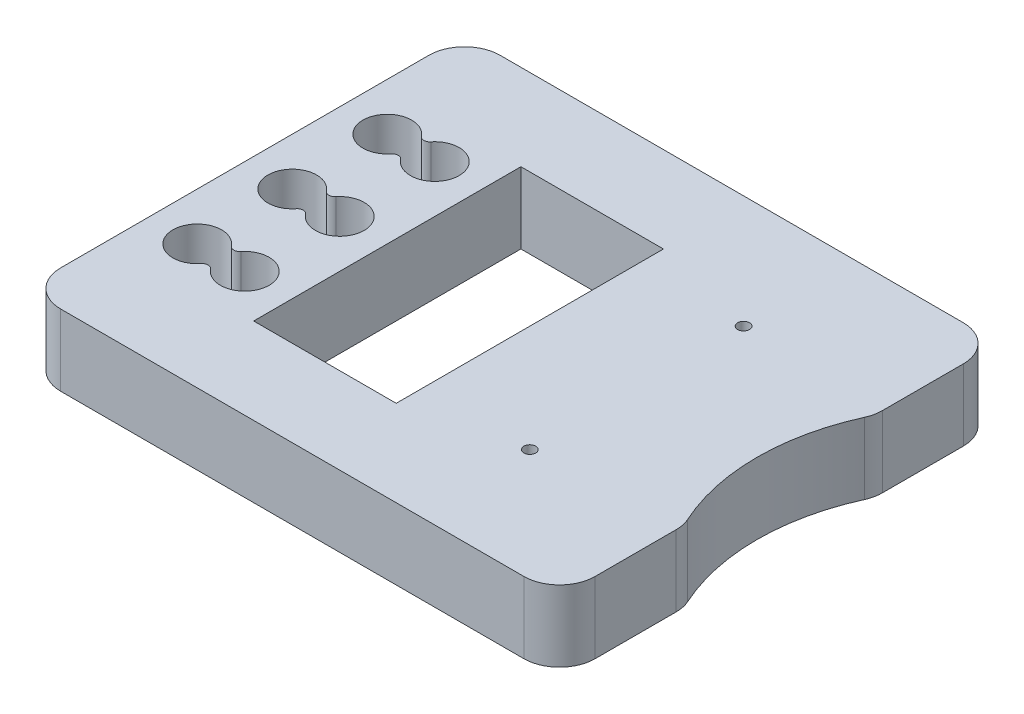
ISO-10303-21;
HEADER;
FILE_DESCRIPTION(('STEP AP214'),'2;1');
FILE_NAME('part.step','',(''),(''),'','','');
FILE_SCHEMA(('AUTOMOTIVE_DESIGN { 1 0 10303 214 1 1 1 1 }'));
ENDSEC;
DATA;
#1=APPLICATION_CONTEXT('core data for automotive mechanical design processes');
#2=APPLICATION_PROTOCOL_DEFINITION('international standard','automotive_design',2000,#1);
#3=PRODUCT_CONTEXT('',#1,'mechanical');
#4=PRODUCT('Part','Part','',(#3));
#5=PRODUCT_RELATED_PRODUCT_CATEGORY('part','',(#4));
#6=PRODUCT_DEFINITION_FORMATION('','',#4);
#7=PRODUCT_DEFINITION_CONTEXT('part definition',#1,'design');
#8=PRODUCT_DEFINITION('design','',#6,#7);
#9=PRODUCT_DEFINITION_SHAPE('','',#8);
#10=(LENGTH_UNIT() NAMED_UNIT(*) SI_UNIT(.MILLI.,.METRE.));
#11=(NAMED_UNIT(*) PLANE_ANGLE_UNIT() SI_UNIT($,.RADIAN.));
#12=(NAMED_UNIT(*) SI_UNIT($,.STERADIAN.) SOLID_ANGLE_UNIT());
#13=UNCERTAINTY_MEASURE_WITH_UNIT(LENGTH_MEASURE(1.E-05),#10,'distance_accuracy_value','');
#14=(GEOMETRIC_REPRESENTATION_CONTEXT(3) GLOBAL_UNCERTAINTY_ASSIGNED_CONTEXT((#13)) GLOBAL_UNIT_ASSIGNED_CONTEXT((#10,
#11,#12)) REPRESENTATION_CONTEXT('',''));
#15=CARTESIAN_POINT('',(0.,0.,0.));
#16=DIRECTION('',(0.,0.,1.));
#17=DIRECTION('',(1.,0.,0.));
#18=AXIS2_PLACEMENT_3D('',#15,#16,#17);
#19=CARTESIAN_POINT('',(61.1245154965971,6.,-18.5));
#20=DIRECTION('',(0.,-1.,0.));
#21=DIRECTION('',(0.,0.,-1.));
#22=AXIS2_PLACEMENT_3D('',#19,#20,#21);
#23=CYLINDRICAL_SURFACE('',#22,18.);
#24=CARTESIAN_POINT('',(61.1245154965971,0.,-18.5));
#25=DIRECTION('',(0.,1.,0.));
#26=DIRECTION('',(0.,0.,1.));
#27=AXIS2_PLACEMENT_3D('',#24,#25,#26);
#28=CIRCLE('',#27,18.);
#29=CARTESIAN_POINT('',(44.732073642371,0.,-25.9355800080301));
#30=VERTEX_POINT('',#29);
#31=CARTESIAN_POINT('',(44.732073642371,0.,-11.0644199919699));
#32=VERTEX_POINT('',#31);
#33=EDGE_CURVE('E399',#30,#32,#28,.T.);
#34=ORIENTED_EDGE('',*,*,#33,.F.);
#35=DIRECTION('',(0.,-1.,0.));
#36=VECTOR('',#35,1.);
#37=CARTESIAN_POINT('',(44.732073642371,6.,-25.9355800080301));
#38=LINE('',#37,#36);
#39=CARTESIAN_POINT('',(44.732073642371,6.,-25.9355800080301));
#40=VERTEX_POINT('',#39);
#41=EDGE_CURVE('E297',#30,#40,#38,.F.);
#42=ORIENTED_EDGE('',*,*,#41,.T.);
#43=CARTESIAN_POINT('',(61.1245154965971,6.,-18.5));
#44=DIRECTION('',(0.,1.,0.));
#45=DIRECTION('',(0.,0.,1.));
#46=AXIS2_PLACEMENT_3D('',#43,#44,#45);
#47=CIRCLE('',#46,18.);
#48=CARTESIAN_POINT('',(44.732073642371,6.,-11.0644199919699));
#49=VERTEX_POINT('',#48);
#50=EDGE_CURVE('E566',#40,#49,#47,.T.);
#51=ORIENTED_EDGE('',*,*,#50,.T.);
#52=DIRECTION('',(0.,-1.,0.));
#53=VECTOR('',#52,1.);
#54=CARTESIAN_POINT('',(44.732073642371,6.,-11.0644199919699));
#55=LINE('',#54,#53);
#56=EDGE_CURVE('E294',#49,#32,#55,.T.);
#57=ORIENTED_EDGE('',*,*,#56,.T.);
#58=EDGE_LOOP('',(#34,#42,#51,#57));
#59=FACE_BOUND('',#58,.T.);
#60=ADVANCED_FACE('F34',(#59),#23,.F.);
#61=CARTESIAN_POINT('',(45.,6.,0.));
#62=DIRECTION('',(-1.,0.,0.));
#63=DIRECTION('',(0.,0.,1.));
#64=AXIS2_PLACEMENT_3D('',#61,#62,#63);
#65=PLANE('',#64);
#66=DIRECTION('',(0.,0.,-1.));
#67=VECTOR('',#66,1.);
#68=CARTESIAN_POINT('',(45.,0.,0.));
#69=LINE('',#68,#67);
#70=CARTESIAN_POINT('',(45.,0.,-27.1748433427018));
#71=VERTEX_POINT('',#70);
#72=CARTESIAN_POINT('',(45.,0.,-34.));
#73=VERTEX_POINT('',#72);
#74=EDGE_CURVE('E402',#71,#73,#69,.T.);
#75=ORIENTED_EDGE('',*,*,#74,.T.);
#76=DIRECTION('',(0.,-1.,0.));
#77=VECTOR('',#76,1.);
#78=CARTESIAN_POINT('',(45.,6.,-34.));
#79=LINE('',#78,#77);
#80=CARTESIAN_POINT('',(45.,6.,-34.));
#81=VERTEX_POINT('',#80);
#82=EDGE_CURVE('E292',#73,#81,#79,.F.);
#83=ORIENTED_EDGE('',*,*,#82,.T.);
#84=DIRECTION('',(0.,0.,-1.));
#85=VECTOR('',#84,1.);
#86=CARTESIAN_POINT('',(45.,6.,0.));
#87=LINE('',#86,#85);
#88=CARTESIAN_POINT('',(45.,6.,-27.1748433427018));
#89=VERTEX_POINT('',#88);
#90=EDGE_CURVE('E569',#89,#81,#87,.T.);
#91=ORIENTED_EDGE('',*,*,#90,.F.);
#92=DIRECTION('',(0.,1.,0.));
#93=VECTOR('',#92,1.);
#94=CARTESIAN_POINT('',(45.,0.,-27.1748433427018));
#95=LINE('',#94,#93);
#96=EDGE_CURVE('E289',#89,#71,#95,.F.);
#97=ORIENTED_EDGE('',*,*,#96,.T.);
#98=EDGE_LOOP('',(#75,#83,#91,#97));
#99=FACE_BOUND('',#98,.T.);
#100=ADVANCED_FACE('F455',(#99),#65,.F.);
#101=CARTESIAN_POINT('',(0.,6.,-37.));
#102=DIRECTION('',(0.,0.,-1.));
#103=DIRECTION('',(-1.,0.,0.));
#104=AXIS2_PLACEMENT_3D('',#101,#102,#103);
#105=PLANE('',#104);
#106=DIRECTION('',(1.,0.,0.));
#107=VECTOR('',#106,1.);
#108=CARTESIAN_POINT('',(0.,0.,-37.));
#109=LINE('',#108,#107);
#110=CARTESIAN_POINT('',(3.,0.,-37.));
#111=VERTEX_POINT('',#110);
#112=CARTESIAN_POINT('',(42.,0.,-37.));
#113=VERTEX_POINT('',#112);
#114=EDGE_CURVE('E405',#111,#113,#109,.T.);
#115=ORIENTED_EDGE('',*,*,#114,.F.);
#116=DIRECTION('',(0.,-1.,0.));
#117=VECTOR('',#116,1.);
#118=CARTESIAN_POINT('',(3.,6.,-37.));
#119=LINE('',#118,#117);
#120=CARTESIAN_POINT('',(3.,6.,-37.));
#121=VERTEX_POINT('',#120);
#122=EDGE_CURVE('E270',#111,#121,#119,.F.);
#123=ORIENTED_EDGE('',*,*,#122,.T.);
#124=DIRECTION('',(1.,0.,0.));
#125=VECTOR('',#124,1.);
#126=CARTESIAN_POINT('',(0.,6.,-37.));
#127=LINE('',#126,#125);
#128=CARTESIAN_POINT('',(42.,6.,-37.));
#129=VERTEX_POINT('',#128);
#130=EDGE_CURVE('E574',#121,#129,#127,.T.);
#131=ORIENTED_EDGE('',*,*,#130,.T.);
#132=DIRECTION('',(0.,-1.,0.));
#133=VECTOR('',#132,1.);
#134=CARTESIAN_POINT('',(42.,0.,-37.));
#135=LINE('',#134,#133);
#136=EDGE_CURVE('E267',#129,#113,#135,.T.);
#137=ORIENTED_EDGE('',*,*,#136,.T.);
#138=EDGE_LOOP('',(#115,#123,#131,#137));
#139=FACE_BOUND('',#138,.T.);
#140=ADVANCED_FACE('F461',(#139),#105,.T.);
#141=CARTESIAN_POINT('',(0.,6.,0.));
#142=DIRECTION('',(-1.,0.,0.));
#143=DIRECTION('',(0.,0.,1.));
#144=AXIS2_PLACEMENT_3D('',#141,#142,#143);
#145=PLANE('',#144);
#146=DIRECTION('',(0.,0.,-1.));
#147=VECTOR('',#146,1.);
#148=CARTESIAN_POINT('',(0.,6.,0.));
#149=LINE('',#148,#147);
#150=CARTESIAN_POINT('',(0.,6.,-3.));
#151=VERTEX_POINT('',#150);
#152=CARTESIAN_POINT('',(0.,6.,-34.));
#153=VERTEX_POINT('',#152);
#154=EDGE_CURVE('E577',#151,#153,#149,.T.);
#155=ORIENTED_EDGE('',*,*,#154,.T.);
#156=DIRECTION('',(0.,-1.,0.));
#157=VECTOR('',#156,1.);
#158=CARTESIAN_POINT('',(0.,6.,-34.));
#159=LINE('',#158,#157);
#160=CARTESIAN_POINT('',(0.,0.,-34.));
#161=VERTEX_POINT('',#160);
#162=EDGE_CURVE('E247',#153,#161,#159,.T.);
#163=ORIENTED_EDGE('',*,*,#162,.T.);
#164=DIRECTION('',(0.,0.,-1.));
#165=VECTOR('',#164,1.);
#166=CARTESIAN_POINT('',(0.,0.,0.));
#167=LINE('',#166,#165);
#168=CARTESIAN_POINT('',(0.,0.,-3.));
#169=VERTEX_POINT('',#168);
#170=EDGE_CURVE('E409',#169,#161,#167,.T.);
#171=ORIENTED_EDGE('',*,*,#170,.F.);
#172=DIRECTION('',(0.,-1.,0.));
#173=VECTOR('',#172,1.);
#174=CARTESIAN_POINT('',(0.,6.,-3.));
#175=LINE('',#174,#173);
#176=EDGE_CURVE('E245',#169,#151,#175,.F.);
#177=ORIENTED_EDGE('',*,*,#176,.T.);
#178=EDGE_LOOP('',(#155,#163,#171,#177));
#179=FACE_BOUND('',#178,.T.);
#180=ADVANCED_FACE('F615',(#179),#145,.T.);
#181=CARTESIAN_POINT('',(0.,6.,0.));
#182=DIRECTION('',(0.,0.,-1.));
#183=DIRECTION('',(-1.,0.,0.));
#184=AXIS2_PLACEMENT_3D('',#181,#182,#183);
#185=PLANE('',#184);
#186=DIRECTION('',(1.,0.,0.));
#187=VECTOR('',#186,1.);
#188=CARTESIAN_POINT('',(0.,6.,0.));
#189=LINE('',#188,#187);
#190=CARTESIAN_POINT('',(3.,6.,0.));
#191=VERTEX_POINT('',#190);
#192=CARTESIAN_POINT('',(42.,6.,0.));
#193=VERTEX_POINT('',#192);
#194=EDGE_CURVE('E573',#191,#193,#189,.T.);
#195=ORIENTED_EDGE('',*,*,#194,.F.);
#196=DIRECTION('',(0.,-1.,0.));
#197=VECTOR('',#196,1.);
#198=CARTESIAN_POINT('',(3.,0.,0.));
#199=LINE('',#198,#197);
#200=CARTESIAN_POINT('',(3.,0.,0.));
#201=VERTEX_POINT('',#200);
#202=EDGE_CURVE('E286',#191,#201,#199,.T.);
#203=ORIENTED_EDGE('',*,*,#202,.T.);
#204=DIRECTION('',(1.,0.,0.));
#205=VECTOR('',#204,1.);
#206=CARTESIAN_POINT('',(0.,0.,0.));
#207=LINE('',#206,#205);
#208=CARTESIAN_POINT('',(42.,0.,0.));
#209=VERTEX_POINT('',#208);
#210=EDGE_CURVE('E412',#201,#209,#207,.T.);
#211=ORIENTED_EDGE('',*,*,#210,.T.);
#212=DIRECTION('',(0.,-1.,0.));
#213=VECTOR('',#212,1.);
#214=CARTESIAN_POINT('',(42.,6.,0.));
#215=LINE('',#214,#213);
#216=EDGE_CURVE('E284',#209,#193,#215,.F.);
#217=ORIENTED_EDGE('',*,*,#216,.T.);
#218=EDGE_LOOP('',(#195,#203,#211,#217));
#219=FACE_BOUND('',#218,.T.);
#220=ADVANCED_FACE('F481',(#219),#185,.F.);
#221=CARTESIAN_POINT('',(8.,6.,-10.5));
#222=DIRECTION('',(0.,-1.,0.));
#223=DIRECTION('',(0.,0.,-1.));
#224=AXIS2_PLACEMENT_3D('',#221,#222,#223);
#225=CYLINDRICAL_SURFACE('',#224,2.05);
#226=CARTESIAN_POINT('',(8.,6.,-10.5));
#227=DIRECTION('',(0.,1.,0.));
#228=DIRECTION('',(0.,0.,1.));
#229=AXIS2_PLACEMENT_3D('',#226,#227,#228);
#230=CIRCLE('',#229,2.05);
#231=CARTESIAN_POINT('',(6.3921568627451,6.,-9.22825299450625));
#232=VERTEX_POINT('',#231);
#233=CARTESIAN_POINT('',(6.3921568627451,6.,-11.7717470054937));
#234=VERTEX_POINT('',#233);
#235=EDGE_CURVE('E557',#232,#234,#230,.T.);
#236=ORIENTED_EDGE('',*,*,#235,.T.);
#237=DIRECTION('',(0.,-1.,0.));
#238=VECTOR('',#237,1.);
#239=CARTESIAN_POINT('',(6.3921568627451,6.,-11.7717470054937));
#240=LINE('',#239,#238);
#241=CARTESIAN_POINT('',(6.3921568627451,0.,-11.7717470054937));
#242=VERTEX_POINT('',#241);
#243=EDGE_CURVE('E306',#234,#242,#240,.T.);
#244=ORIENTED_EDGE('',*,*,#243,.T.);
#245=CARTESIAN_POINT('',(8.,0.,-10.5));
#246=DIRECTION('',(0.,1.,0.));
#247=DIRECTION('',(0.,0.,1.));
#248=AXIS2_PLACEMENT_3D('',#245,#246,#247);
#249=CIRCLE('',#248,2.05);
#250=CARTESIAN_POINT('',(6.3921568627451,0.,-9.22825299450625));
#251=VERTEX_POINT('',#250);
#252=EDGE_CURVE('E390',#251,#242,#249,.T.);
#253=ORIENTED_EDGE('',*,*,#252,.F.);
#254=DIRECTION('',(0.,-1.,0.));
#255=VECTOR('',#254,1.);
#256=CARTESIAN_POINT('',(6.3921568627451,6.,-9.22825299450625));
#257=LINE('',#256,#255);
#258=EDGE_CURVE('E304',#251,#232,#257,.F.);
#259=ORIENTED_EDGE('',*,*,#258,.T.);
#260=EDGE_LOOP('',(#236,#244,#253,#259));
#261=FACE_BOUND('',#260,.T.);
#262=ADVANCED_FACE('F477',(#261),#225,.F.);
#263=CARTESIAN_POINT('',(8.,6.,-18.5));
#264=DIRECTION('',(0.,-1.,0.));
#265=DIRECTION('',(0.,0.,-1.));
#266=AXIS2_PLACEMENT_3D('',#263,#264,#265);
#267=CYLINDRICAL_SURFACE('',#266,2.05);
#268=CARTESIAN_POINT('',(8.,6.,-18.5));
#269=DIRECTION('',(0.,1.,0.));
#270=DIRECTION('',(0.,0.,1.));
#271=AXIS2_PLACEMENT_3D('',#268,#269,#270);
#272=CIRCLE('',#271,2.05);
#273=CARTESIAN_POINT('',(6.3921568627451,6.,-17.2282529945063));
#274=VERTEX_POINT('',#273);
#275=CARTESIAN_POINT('',(6.3921568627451,6.,-19.7717470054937));
#276=VERTEX_POINT('',#275);
#277=EDGE_CURVE('E552',#274,#276,#272,.T.);
#278=ORIENTED_EDGE('',*,*,#277,.T.);
#279=DIRECTION('',(0.,-1.,0.));
#280=VECTOR('',#279,1.);
#281=CARTESIAN_POINT('',(6.3921568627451,6.,-19.7717470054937));
#282=LINE('',#281,#280);
#283=CARTESIAN_POINT('',(6.3921568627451,0.,-19.7717470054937));
#284=VERTEX_POINT('',#283);
#285=EDGE_CURVE('E339',#276,#284,#282,.T.);
#286=ORIENTED_EDGE('',*,*,#285,.T.);
#287=CARTESIAN_POINT('',(8.,0.,-18.5));
#288=DIRECTION('',(0.,1.,0.));
#289=DIRECTION('',(0.,0.,1.));
#290=AXIS2_PLACEMENT_3D('',#287,#288,#289);
#291=CIRCLE('',#290,2.05);
#292=CARTESIAN_POINT('',(6.3921568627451,0.,-17.2282529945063));
#293=VERTEX_POINT('',#292);
#294=EDGE_CURVE('E384',#293,#284,#291,.T.);
#295=ORIENTED_EDGE('',*,*,#294,.F.);
#296=DIRECTION('',(0.,-1.,0.));
#297=VECTOR('',#296,1.);
#298=CARTESIAN_POINT('',(6.3921568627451,6.,-17.2282529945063));
#299=LINE('',#298,#297);
#300=EDGE_CURVE('E337',#293,#274,#299,.F.);
#301=ORIENTED_EDGE('',*,*,#300,.T.);
#302=EDGE_LOOP('',(#278,#286,#295,#301));
#303=FACE_BOUND('',#302,.T.);
#304=ADVANCED_FACE('F480',(#303),#267,.F.);
#305=CARTESIAN_POINT('',(0.,6.,-29.75));
#306=DIRECTION('',(0.,0.,-1.));
#307=DIRECTION('',(-1.,0.,0.));
#308=AXIS2_PLACEMENT_3D('',#305,#306,#307);
#309=PLANE('',#308);
#310=DIRECTION('',(1.,0.,0.));
#311=VECTOR('',#310,1.);
#312=CARTESIAN_POINT('',(0.,0.,-29.75));
#313=LINE('',#312,#311);
#314=CARTESIAN_POINT('',(12.,0.,-29.75));
#315=VERTEX_POINT('',#314);
#316=CARTESIAN_POINT('',(24.,0.,-29.75));
#317=VERTEX_POINT('',#316);
#318=EDGE_CURVE('E244',#315,#317,#313,.T.);
#319=ORIENTED_EDGE('',*,*,#318,.T.);
#320=DIRECTION('',(0.,-1.,0.));
#321=VECTOR('',#320,1.);
#322=CARTESIAN_POINT('',(24.,6.,-29.75));
#323=LINE('',#322,#321);
#324=CARTESIAN_POINT('',(24.,6.,-29.75));
#325=VERTEX_POINT('',#324);
#326=EDGE_CURVE('E225',#325,#317,#323,.T.);
#327=ORIENTED_EDGE('',*,*,#326,.F.);
#328=DIRECTION('',(1.,0.,0.));
#329=VECTOR('',#328,1.);
#330=CARTESIAN_POINT('',(0.,6.,-29.75));
#331=LINE('',#330,#329);
#332=CARTESIAN_POINT('',(12.,6.,-29.75));
#333=VERTEX_POINT('',#332);
#334=EDGE_CURVE('E232',#333,#325,#331,.T.);
#335=ORIENTED_EDGE('',*,*,#334,.F.);
#336=DIRECTION('',(0.,-1.,0.));
#337=VECTOR('',#336,1.);
#338=CARTESIAN_POINT('',(12.,6.,-29.75));
#339=LINE('',#338,#337);
#340=EDGE_CURVE('E418',#333,#315,#339,.T.);
#341=ORIENTED_EDGE('',*,*,#340,.T.);
#342=EDGE_LOOP('',(#319,#327,#335,#341));
#343=FACE_BOUND('',#342,.T.);
#344=ADVANCED_FACE('F242',(#343),#309,.F.);
#345=CARTESIAN_POINT('',(24.,6.,0.));
#346=DIRECTION('',(1.,0.,0.));
#347=DIRECTION('',(0.,0.,-1.));
#348=AXIS2_PLACEMENT_3D('',#345,#346,#347);
#349=PLANE('',#348);
#350=DIRECTION('',(0.,0.,1.));
#351=VECTOR('',#350,1.);
#352=CARTESIAN_POINT('',(24.,0.,0.));
#353=LINE('',#352,#351);
#354=CARTESIAN_POINT('',(24.,0.,-7.25));
#355=VERTEX_POINT('',#354);
#356=EDGE_CURVE('E376',#317,#355,#353,.T.);
#357=ORIENTED_EDGE('',*,*,#356,.T.);
#358=DIRECTION('',(0.,-1.,0.));
#359=VECTOR('',#358,1.);
#360=CARTESIAN_POINT('',(24.,6.,-7.25));
#361=LINE('',#360,#359);
#362=CARTESIAN_POINT('',(24.,6.,-7.25));
#363=VERTEX_POINT('',#362);
#364=EDGE_CURVE('E227',#363,#355,#361,.T.);
#365=ORIENTED_EDGE('',*,*,#364,.F.);
#366=DIRECTION('',(0.,0.,1.));
#367=VECTOR('',#366,1.);
#368=CARTESIAN_POINT('',(24.,6.,0.));
#369=LINE('',#368,#367);
#370=EDGE_CURVE('E220',#325,#363,#369,.T.);
#371=ORIENTED_EDGE('',*,*,#370,.F.);
#372=ORIENTED_EDGE('',*,*,#326,.T.);
#373=EDGE_LOOP('',(#357,#365,#371,#372));
#374=FACE_BOUND('',#373,.T.);
#375=ADVANCED_FACE('F223',(#374),#349,.F.);
#376=CARTESIAN_POINT('',(0.,6.,-7.25));
#377=DIRECTION('',(0.,0.,-1.));
#378=DIRECTION('',(-1.,0.,0.));
#379=AXIS2_PLACEMENT_3D('',#376,#377,#378);
#380=PLANE('',#379);
#381=DIRECTION('',(1.,0.,0.));
#382=VECTOR('',#381,1.);
#383=CARTESIAN_POINT('',(0.,0.,-7.25));
#384=LINE('',#383,#382);
#385=CARTESIAN_POINT('',(12.,0.,-7.25));
#386=VERTEX_POINT('',#385);
#387=EDGE_CURVE('E378',#386,#355,#384,.T.);
#388=ORIENTED_EDGE('',*,*,#387,.F.);
#389=DIRECTION('',(0.,-1.,0.));
#390=VECTOR('',#389,1.);
#391=CARTESIAN_POINT('',(12.,6.,-7.25));
#392=LINE('',#391,#390);
#393=CARTESIAN_POINT('',(12.,6.,-7.25));
#394=VERTEX_POINT('',#393);
#395=EDGE_CURVE('E249',#394,#386,#392,.T.);
#396=ORIENTED_EDGE('',*,*,#395,.F.);
#397=DIRECTION('',(1.,0.,0.));
#398=VECTOR('',#397,1.);
#399=CARTESIAN_POINT('',(0.,6.,-7.25));
#400=LINE('',#399,#398);
#401=EDGE_CURVE('E231',#394,#363,#400,.T.);
#402=ORIENTED_EDGE('',*,*,#401,.T.);
#403=ORIENTED_EDGE('',*,*,#364,.T.);
#404=EDGE_LOOP('',(#388,#396,#402,#403));
#405=FACE_BOUND('',#404,.T.);
#406=ADVANCED_FACE('F424',(#405),#380,.T.);
#407=CARTESIAN_POINT('',(8.,6.,-26.5));
#408=DIRECTION('',(0.,-1.,0.));
#409=DIRECTION('',(0.,0.,-1.));
#410=AXIS2_PLACEMENT_3D('',#407,#408,#409);
#411=CYLINDRICAL_SURFACE('',#410,2.05);
#412=CARTESIAN_POINT('',(8.,0.,-26.5));
#413=DIRECTION('',(0.,1.,0.));
#414=DIRECTION('',(0.,0.,1.));
#415=AXIS2_PLACEMENT_3D('',#412,#413,#414);
#416=CIRCLE('',#415,2.05);
#417=CARTESIAN_POINT('',(6.3921568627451,0.,-27.7717470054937));
#418=VERTEX_POINT('',#417);
#419=CARTESIAN_POINT('',(6.3921568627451,0.,-25.2282529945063));
#420=VERTEX_POINT('',#419);
#421=EDGE_CURVE('E357',#418,#420,#416,.F.);
#422=ORIENTED_EDGE('',*,*,#421,.T.);
#423=DIRECTION('',(0.,-1.,0.));
#424=VECTOR('',#423,1.);
#425=CARTESIAN_POINT('',(6.3921568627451,6.,-25.2282529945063));
#426=LINE('',#425,#424);
#427=CARTESIAN_POINT('',(6.3921568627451,6.,-25.2282529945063));
#428=VERTEX_POINT('',#427);
#429=EDGE_CURVE('E11',#420,#428,#426,.F.);
#430=ORIENTED_EDGE('',*,*,#429,.T.);
#431=CARTESIAN_POINT('',(8.,6.,-26.5));
#432=DIRECTION('',(0.,1.,0.));
#433=DIRECTION('',(0.,0.,1.));
#434=AXIS2_PLACEMENT_3D('',#431,#432,#433);
#435=CIRCLE('',#434,2.05);
#436=CARTESIAN_POINT('',(6.3921568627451,6.,-27.7717470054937));
#437=VERTEX_POINT('',#436);
#438=EDGE_CURVE('E360',#437,#428,#435,.F.);
#439=ORIENTED_EDGE('',*,*,#438,.F.);
#440=DIRECTION('',(0.,-1.,0.));
#441=VECTOR('',#440,1.);
#442=CARTESIAN_POINT('',(6.3921568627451,6.,-27.7717470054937));
#443=LINE('',#442,#441);
#444=EDGE_CURVE('E42',#437,#418,#443,.T.);
#445=ORIENTED_EDGE('',*,*,#444,.T.);
#446=EDGE_LOOP('',(#422,#430,#439,#445));
#447=FACE_BOUND('',#446,.T.);
#448=ADVANCED_FACE('F356',(#447),#411,.F.);
#449=CARTESIAN_POINT('',(45.,0.,-3.));
#450=VERTEX_POINT('',#449);
#451=CARTESIAN_POINT('',(45.,0.,-9.82515665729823));
#452=VERTEX_POINT('',#451);
#453=EDGE_CURVE('E406',#450,#452,#69,.T.);
#454=ORIENTED_EDGE('',*,*,#453,.T.);
#455=DIRECTION('',(0.,1.,0.));
#456=VECTOR('',#455,1.);
#457=CARTESIAN_POINT('',(45.,6.,-9.82515665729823));
#458=LINE('',#457,#456);
#459=CARTESIAN_POINT('',(45.,6.,-9.82515665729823));
#460=VERTEX_POINT('',#459);
#461=EDGE_CURVE('E302',#452,#460,#458,.T.);
#462=ORIENTED_EDGE('',*,*,#461,.T.);
#463=CARTESIAN_POINT('',(45.,6.,-3.));
#464=VERTEX_POINT('',#463);
#465=EDGE_CURVE('E570',#464,#460,#87,.T.);
#466=ORIENTED_EDGE('',*,*,#465,.F.);
#467=DIRECTION('',(0.,-1.,0.));
#468=VECTOR('',#467,1.);
#469=CARTESIAN_POINT('',(45.,6.,-3.));
#470=LINE('',#469,#468);
#471=EDGE_CURVE('E299',#464,#450,#470,.T.);
#472=ORIENTED_EDGE('',*,*,#471,.T.);
#473=EDGE_LOOP('',(#454,#462,#466,#472));
#474=FACE_BOUND('',#473,.T.);
#475=ADVANCED_FACE('F463',(#474),#65,.F.);
#476=CARTESIAN_POINT('',(33.,6.,-27.5));
#477=DIRECTION('',(0.,-1.,0.));
#478=DIRECTION('',(0.,0.,-1.));
#479=AXIS2_PLACEMENT_3D('',#476,#477,#478);
#480=CYLINDRICAL_SURFACE('',#479,0.499999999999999);
#481=CARTESIAN_POINT('',(33.,6.,-27.5));
#482=DIRECTION('',(0.,1.,0.));
#483=DIRECTION('',(0.,0.,1.));
#484=AXIS2_PLACEMENT_3D('',#481,#482,#483);
#485=CIRCLE('',#484,0.499999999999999);
#486=CARTESIAN_POINT('',(33.,6.,-27.));
#487=VERTEX_POINT('',#486);
#488=EDGE_CURVE('E563',#487,#487,#485,.T.);
#489=ORIENTED_EDGE('',*,*,#488,.T.);
#490=EDGE_LOOP('',(#489));
#491=FACE_BOUND('',#490,.T.);
#492=CARTESIAN_POINT('',(33.,0.,-27.5));
#493=DIRECTION('',(0.,1.,0.));
#494=DIRECTION('',(0.,0.,1.));
#495=AXIS2_PLACEMENT_3D('',#492,#493,#494);
#496=CIRCLE('',#495,0.499999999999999);
#497=CARTESIAN_POINT('',(33.,0.,-27.));
#498=VERTEX_POINT('',#497);
#499=EDGE_CURVE('E396',#498,#498,#496,.T.);
#500=ORIENTED_EDGE('',*,*,#499,.F.);
#501=EDGE_LOOP('',(#500));
#502=FACE_BOUND('',#501,.T.);
#503=ADVANCED_FACE('F468',(#491,#502),#480,.F.);
#504=CARTESIAN_POINT('',(4.,6.,-10.5));
#505=DIRECTION('',(0.,-1.,0.));
#506=DIRECTION('',(0.,0.,-1.));
#507=AXIS2_PLACEMENT_3D('',#504,#505,#506);
#508=CYLINDRICAL_SURFACE('',#507,2.05);
#509=CARTESIAN_POINT('',(4.,0.,-10.5));
#510=DIRECTION('',(0.,1.,0.));
#511=DIRECTION('',(0.,0.,1.));
#512=AXIS2_PLACEMENT_3D('',#509,#510,#511);
#513=CIRCLE('',#512,2.05);
#514=CARTESIAN_POINT('',(5.6078431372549,0.,-11.7717470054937));
#515=VERTEX_POINT('',#514);
#516=CARTESIAN_POINT('',(5.6078431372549,0.,-9.22825299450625));
#517=VERTEX_POINT('',#516);
#518=EDGE_CURVE('E393',#515,#517,#513,.T.);
#519=ORIENTED_EDGE('',*,*,#518,.F.);
#520=DIRECTION('',(0.,-1.,0.));
#521=VECTOR('',#520,1.);
#522=CARTESIAN_POINT('',(5.6078431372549,6.,-11.7717470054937));
#523=LINE('',#522,#521);
#524=CARTESIAN_POINT('',(5.6078431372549,6.,-11.7717470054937));
#525=VERTEX_POINT('',#524);
#526=EDGE_CURVE('E324',#515,#525,#523,.F.);
#527=ORIENTED_EDGE('',*,*,#526,.T.);
#528=CARTESIAN_POINT('',(4.,6.,-10.5));
#529=DIRECTION('',(0.,1.,0.));
#530=DIRECTION('',(0.,0.,1.));
#531=AXIS2_PLACEMENT_3D('',#528,#529,#530);
#532=CIRCLE('',#531,2.05);
#533=CARTESIAN_POINT('',(5.6078431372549,6.,-9.22825299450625));
#534=VERTEX_POINT('',#533);
#535=EDGE_CURVE('E560',#525,#534,#532,.T.);
#536=ORIENTED_EDGE('',*,*,#535,.T.);
#537=DIRECTION('',(0.,-1.,0.));
#538=VECTOR('',#537,1.);
#539=CARTESIAN_POINT('',(5.6078431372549,6.,-9.22825299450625));
#540=LINE('',#539,#538);
#541=EDGE_CURVE('E321',#534,#517,#540,.T.);
#542=ORIENTED_EDGE('',*,*,#541,.T.);
#543=EDGE_LOOP('',(#519,#527,#536,#542));
#544=FACE_BOUND('',#543,.T.);
#545=ADVANCED_FACE('F471',(#544),#508,.F.);
#546=CARTESIAN_POINT('',(4.,6.,-18.5));
#547=DIRECTION('',(0.,-1.,0.));
#548=DIRECTION('',(0.,0.,-1.));
#549=AXIS2_PLACEMENT_3D('',#546,#547,#548);
#550=CYLINDRICAL_SURFACE('',#549,2.05);
#551=CARTESIAN_POINT('',(4.,0.,-18.5));
#552=DIRECTION('',(0.,1.,0.));
#553=DIRECTION('',(0.,0.,1.));
#554=AXIS2_PLACEMENT_3D('',#551,#552,#553);
#555=CIRCLE('',#554,2.05);
#556=CARTESIAN_POINT('',(5.6078431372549,0.,-19.7717470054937));
#557=VERTEX_POINT('',#556);
#558=CARTESIAN_POINT('',(5.6078431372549,0.,-17.2282529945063));
#559=VERTEX_POINT('',#558);
#560=EDGE_CURVE('E387',#557,#559,#555,.T.);
#561=ORIENTED_EDGE('',*,*,#560,.F.);
#562=DIRECTION('',(0.,-1.,0.));
#563=VECTOR('',#562,1.);
#564=CARTESIAN_POINT('',(5.6078431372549,6.,-19.7717470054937));
#565=LINE('',#564,#563);
#566=CARTESIAN_POINT('',(5.6078431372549,6.,-19.7717470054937));
#567=VERTEX_POINT('',#566);
#568=EDGE_CURVE('E56',#557,#567,#565,.F.);
#569=ORIENTED_EDGE('',*,*,#568,.T.);
#570=CARTESIAN_POINT('',(4.,6.,-18.5));
#571=DIRECTION('',(0.,1.,0.));
#572=DIRECTION('',(0.,0.,1.));
#573=AXIS2_PLACEMENT_3D('',#570,#571,#572);
#574=CIRCLE('',#573,2.05);
#575=CARTESIAN_POINT('',(5.6078431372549,6.,-17.2282529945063));
#576=VERTEX_POINT('',#575);
#577=EDGE_CURVE('E555',#567,#576,#574,.T.);
#578=ORIENTED_EDGE('',*,*,#577,.T.);
#579=DIRECTION('',(0.,-1.,0.));
#580=VECTOR('',#579,1.);
#581=CARTESIAN_POINT('',(5.6078431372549,6.,-17.2282529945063));
#582=LINE('',#581,#580);
#583=EDGE_CURVE('E342',#576,#559,#582,.T.);
#584=ORIENTED_EDGE('',*,*,#583,.T.);
#585=EDGE_LOOP('',(#561,#569,#578,#584));
#586=FACE_BOUND('',#585,.T.);
#587=ADVANCED_FACE('F475',(#586),#550,.F.);
#588=CARTESIAN_POINT('',(12.,6.,0.));
#589=DIRECTION('',(1.,0.,0.));
#590=DIRECTION('',(0.,0.,-1.));
#591=AXIS2_PLACEMENT_3D('',#588,#589,#590);
#592=PLANE('',#591);
#593=DIRECTION('',(0.,0.,1.));
#594=VECTOR('',#593,1.);
#595=CARTESIAN_POINT('',(12.,0.,0.));
#596=LINE('',#595,#594);
#597=EDGE_CURVE('E381',#315,#386,#596,.T.);
#598=ORIENTED_EDGE('',*,*,#597,.F.);
#599=ORIENTED_EDGE('',*,*,#340,.F.);
#600=DIRECTION('',(0.,0.,1.));
#601=VECTOR('',#600,1.);
#602=CARTESIAN_POINT('',(12.,6.,0.));
#603=LINE('',#602,#601);
#604=EDGE_CURVE('E238',#333,#394,#603,.T.);
#605=ORIENTED_EDGE('',*,*,#604,.T.);
#606=ORIENTED_EDGE('',*,*,#395,.T.);
#607=EDGE_LOOP('',(#598,#599,#605,#606));
#608=FACE_BOUND('',#607,.T.);
#609=ADVANCED_FACE('F422',(#608),#592,.T.);
#610=CARTESIAN_POINT('',(4.,6.,-26.5));
#611=DIRECTION('',(0.,-1.,0.));
#612=DIRECTION('',(0.,0.,-1.));
#613=AXIS2_PLACEMENT_3D('',#610,#611,#612);
#614=CYLINDRICAL_SURFACE('',#613,2.05);
#615=CARTESIAN_POINT('',(4.,6.,-26.5));
#616=DIRECTION('',(0.,1.,0.));
#617=DIRECTION('',(0.,0.,1.));
#618=AXIS2_PLACEMENT_3D('',#615,#616,#617);
#619=CIRCLE('',#618,2.05);
#620=CARTESIAN_POINT('',(5.6078431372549,6.,-25.2282529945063));
#621=VERTEX_POINT('',#620);
#622=CARTESIAN_POINT('',(5.6078431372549,6.,-27.7717470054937));
#623=VERTEX_POINT('',#622);
#624=EDGE_CURVE('E240',#621,#623,#619,.F.);
#625=ORIENTED_EDGE('',*,*,#624,.F.);
#626=DIRECTION('',(0.,-1.,0.));
#627=VECTOR('',#626,1.);
#628=CARTESIAN_POINT('',(5.6078431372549,6.,-25.2282529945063));
#629=LINE('',#628,#627);
#630=CARTESIAN_POINT('',(5.6078431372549,0.,-25.2282529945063));
#631=VERTEX_POINT('',#630);
#632=EDGE_CURVE('E348',#621,#631,#629,.T.);
#633=ORIENTED_EDGE('',*,*,#632,.T.);
#634=CARTESIAN_POINT('',(4.,0.,-26.5));
#635=DIRECTION('',(0.,1.,0.));
#636=DIRECTION('',(0.,0.,1.));
#637=AXIS2_PLACEMENT_3D('',#634,#635,#636);
#638=CIRCLE('',#637,2.05);
#639=CARTESIAN_POINT('',(5.6078431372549,0.,-27.7717470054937));
#640=VERTEX_POINT('',#639);
#641=EDGE_CURVE('E368',#631,#640,#638,.F.);
#642=ORIENTED_EDGE('',*,*,#641,.T.);
#643=DIRECTION('',(0.,-1.,0.));
#644=VECTOR('',#643,1.);
#645=CARTESIAN_POINT('',(5.6078431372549,6.,-27.7717470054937));
#646=LINE('',#645,#644);
#647=EDGE_CURVE('E346',#640,#623,#646,.F.);
#648=ORIENTED_EDGE('',*,*,#647,.T.);
#649=EDGE_LOOP('',(#625,#633,#642,#648));
#650=FACE_BOUND('',#649,.T.);
#651=ADVANCED_FACE('F441',(#650),#614,.F.);
#652=CARTESIAN_POINT('',(33.,6.,-9.5));
#653=DIRECTION('',(0.,-1.,0.));
#654=DIRECTION('',(0.,0.,-1.));
#655=AXIS2_PLACEMENT_3D('',#652,#653,#654);
#656=CYLINDRICAL_SURFACE('',#655,0.499999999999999);
#657=CARTESIAN_POINT('',(33.,6.,-9.5));
#658=DIRECTION('',(0.,1.,0.));
#659=DIRECTION('',(0.,0.,1.));
#660=AXIS2_PLACEMENT_3D('',#657,#658,#659);
#661=CIRCLE('',#660,0.499999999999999);
#662=CARTESIAN_POINT('',(33.,6.,-9.));
#663=VERTEX_POINT('',#662);
#664=EDGE_CURVE('E372',#663,#663,#661,.F.);
#665=ORIENTED_EDGE('',*,*,#664,.F.);
#666=EDGE_LOOP('',(#665));
#667=FACE_BOUND('',#666,.T.);
#668=CARTESIAN_POINT('',(33.,0.,-9.5));
#669=DIRECTION('',(0.,1.,0.));
#670=DIRECTION('',(0.,0.,1.));
#671=AXIS2_PLACEMENT_3D('',#668,#669,#670);
#672=CIRCLE('',#671,0.499999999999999);
#673=CARTESIAN_POINT('',(33.,0.,-9.));
#674=VERTEX_POINT('',#673);
#675=EDGE_CURVE('E415',#674,#674,#672,.F.);
#676=ORIENTED_EDGE('',*,*,#675,.T.);
#677=EDGE_LOOP('',(#676));
#678=FACE_BOUND('',#677,.T.);
#679=ADVANCED_FACE('F439',(#667,#678),#656,.F.);
#680=CARTESIAN_POINT('',(0.,6.,0.));
#681=DIRECTION('',(0.,1.,0.));
#682=DIRECTION('',(0.,0.,1.));
#683=AXIS2_PLACEMENT_3D('',#680,#681,#682);
#684=PLANE('',#683);
#685=ORIENTED_EDGE('',*,*,#438,.T.);
#686=CARTESIAN_POINT('',(6.,6.,-24.9180707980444));
#687=DIRECTION('',(0.,1.,0.));
#688=DIRECTION('',(0.,0.,1.));
#689=AXIS2_PLACEMENT_3D('',#686,#687,#688);
#690=CIRCLE('',#689,0.5);
#691=EDGE_CURVE('E328',#428,#621,#690,.T.);
#692=ORIENTED_EDGE('',*,*,#691,.T.);
#693=ORIENTED_EDGE('',*,*,#624,.T.);
#694=CARTESIAN_POINT('',(6.,6.,-28.0819292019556));
#695=DIRECTION('',(0.,1.,0.));
#696=DIRECTION('',(0.,0.,1.));
#697=AXIS2_PLACEMENT_3D('',#694,#695,#696);
#698=CIRCLE('',#697,0.5);
#699=EDGE_CURVE('E326',#623,#437,#698,.T.);
#700=ORIENTED_EDGE('',*,*,#699,.T.);
#701=EDGE_LOOP('',(#685,#692,#693,#700));
#702=FACE_BOUND('',#701,.T.);
#703=ORIENTED_EDGE('',*,*,#334,.T.);
#704=ORIENTED_EDGE('',*,*,#370,.T.);
#705=ORIENTED_EDGE('',*,*,#401,.F.);
#706=ORIENTED_EDGE('',*,*,#604,.F.);
#707=EDGE_LOOP('',(#703,#704,#705,#706));
#708=FACE_BOUND('',#707,.T.);
#709=ORIENTED_EDGE('',*,*,#577,.F.);
#710=CARTESIAN_POINT('',(6.,6.,-20.0819292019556));
#711=DIRECTION('',(0.,1.,0.));
#712=DIRECTION('',(0.,0.,1.));
#713=AXIS2_PLACEMENT_3D('',#710,#711,#712);
#714=CIRCLE('',#713,0.5);
#715=EDGE_CURVE('E333',#567,#276,#714,.T.);
#716=ORIENTED_EDGE('',*,*,#715,.T.);
#717=ORIENTED_EDGE('',*,*,#277,.F.);
#718=CARTESIAN_POINT('',(6.,6.,-16.9180707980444));
#719=DIRECTION('',(0.,1.,0.));
#720=DIRECTION('',(0.,0.,1.));
#721=AXIS2_PLACEMENT_3D('',#718,#719,#720);
#722=CIRCLE('',#721,0.5);
#723=EDGE_CURVE('E49',#274,#576,#722,.T.);
#724=ORIENTED_EDGE('',*,*,#723,.T.);
#725=EDGE_LOOP('',(#709,#716,#717,#724));
#726=FACE_BOUND('',#725,.T.);
#727=ORIENTED_EDGE('',*,*,#535,.F.);
#728=CARTESIAN_POINT('',(6.,6.,-12.0819292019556));
#729=DIRECTION('',(0.,1.,0.));
#730=DIRECTION('',(0.,0.,1.));
#731=AXIS2_PLACEMENT_3D('',#728,#729,#730);
#732=CIRCLE('',#731,0.5);
#733=EDGE_CURVE('E335',#525,#234,#732,.T.);
#734=ORIENTED_EDGE('',*,*,#733,.T.);
#735=ORIENTED_EDGE('',*,*,#235,.F.);
#736=CARTESIAN_POINT('',(6.,6.,-8.91807079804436));
#737=DIRECTION('',(0.,1.,0.));
#738=DIRECTION('',(0.,0.,1.));
#739=AXIS2_PLACEMENT_3D('',#736,#737,#738);
#740=CIRCLE('',#739,0.5);
#741=EDGE_CURVE('E331',#232,#534,#740,.T.);
#742=ORIENTED_EDGE('',*,*,#741,.T.);
#743=EDGE_LOOP('',(#727,#734,#735,#742));
#744=FACE_BOUND('',#743,.T.);
#745=ORIENTED_EDGE('',*,*,#488,.F.);
#746=EDGE_LOOP('',(#745));
#747=FACE_BOUND('',#746,.T.);
#748=ORIENTED_EDGE('',*,*,#130,.F.);
#749=CARTESIAN_POINT('',(3.,6.,-34.));
#750=DIRECTION('',(0.,1.,0.));
#751=DIRECTION('',(0.,0.,1.));
#752=AXIS2_PLACEMENT_3D('',#749,#750,#751);
#753=CIRCLE('',#752,3.);
#754=EDGE_CURVE('E282',#121,#153,#753,.T.);
#755=ORIENTED_EDGE('',*,*,#754,.T.);
#756=ORIENTED_EDGE('',*,*,#154,.F.);
#757=CARTESIAN_POINT('',(3.,6.,-3.));
#758=DIRECTION('',(0.,1.,0.));
#759=DIRECTION('',(0.,0.,1.));
#760=AXIS2_PLACEMENT_3D('',#757,#758,#759);
#761=CIRCLE('',#760,3.);
#762=EDGE_CURVE('E280',#151,#191,#761,.T.);
#763=ORIENTED_EDGE('',*,*,#762,.T.);
#764=ORIENTED_EDGE('',*,*,#194,.T.);
#765=CARTESIAN_POINT('',(42.,6.,-3.));
#766=DIRECTION('',(0.,1.,0.));
#767=DIRECTION('',(0.,0.,1.));
#768=AXIS2_PLACEMENT_3D('',#765,#766,#767);
#769=CIRCLE('',#768,3.);
#770=EDGE_CURVE('E272',#193,#464,#769,.T.);
#771=ORIENTED_EDGE('',*,*,#770,.T.);
#772=ORIENTED_EDGE('',*,*,#465,.T.);
#773=CARTESIAN_POINT('',(42.,6.,-9.82515665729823));
#774=DIRECTION('',(0.,1.,0.));
#775=DIRECTION('',(0.,0.,1.));
#776=AXIS2_PLACEMENT_3D('',#773,#774,#775);
#777=CIRCLE('',#776,3.);
#778=EDGE_CURVE('E274',#460,#49,#777,.T.);
#779=ORIENTED_EDGE('',*,*,#778,.T.);
#780=ORIENTED_EDGE('',*,*,#50,.F.);
#781=CARTESIAN_POINT('',(42.,6.,-27.1748433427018));
#782=DIRECTION('',(0.,1.,0.));
#783=DIRECTION('',(0.,0.,1.));
#784=AXIS2_PLACEMENT_3D('',#781,#782,#783);
#785=CIRCLE('',#784,3.);
#786=EDGE_CURVE('E276',#40,#89,#785,.T.);
#787=ORIENTED_EDGE('',*,*,#786,.T.);
#788=ORIENTED_EDGE('',*,*,#90,.T.);
#789=CARTESIAN_POINT('',(42.,6.,-34.));
#790=DIRECTION('',(0.,1.,0.));
#791=DIRECTION('',(0.,0.,1.));
#792=AXIS2_PLACEMENT_3D('',#789,#790,#791);
#793=CIRCLE('',#792,3.);
#794=EDGE_CURVE('E278',#81,#129,#793,.T.);
#795=ORIENTED_EDGE('',*,*,#794,.T.);
#796=EDGE_LOOP('',(#748,#755,#756,#763,#764,#771,#772,#779,#780,#787,#788,#795));
#797=FACE_BOUND('',#796,.T.);
#798=ORIENTED_EDGE('',*,*,#664,.T.);
#799=EDGE_LOOP('',(#798));
#800=FACE_BOUND('',#799,.T.);
#801=ADVANCED_FACE('F236',(#702,#708,#726,#744,#747,#797,#800),#684,.T.);
#802=CARTESIAN_POINT('',(0.,0.,0.));
#803=DIRECTION('',(0.,1.,0.));
#804=DIRECTION('',(0.,0.,1.));
#805=AXIS2_PLACEMENT_3D('',#802,#803,#804);
#806=PLANE('',#805);
#807=ORIENTED_EDGE('',*,*,#641,.F.);
#808=CARTESIAN_POINT('',(6.,0.,-24.9180707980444));
#809=DIRECTION('',(0.,1.,0.));
#810=DIRECTION('',(0.,0.,1.));
#811=AXIS2_PLACEMENT_3D('',#808,#809,#810);
#812=CIRCLE('',#811,0.5);
#813=EDGE_CURVE('E311',#631,#420,#812,.F.);
#814=ORIENTED_EDGE('',*,*,#813,.T.);
#815=ORIENTED_EDGE('',*,*,#421,.F.);
#816=CARTESIAN_POINT('',(6.,0.,-28.0819292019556));
#817=DIRECTION('',(0.,1.,0.));
#818=DIRECTION('',(0.,0.,1.));
#819=AXIS2_PLACEMENT_3D('',#816,#817,#818);
#820=CIRCLE('',#819,0.5);
#821=EDGE_CURVE('E309',#418,#640,#820,.F.);
#822=ORIENTED_EDGE('',*,*,#821,.T.);
#823=EDGE_LOOP('',(#807,#814,#815,#822));
#824=FACE_BOUND('',#823,.T.);
#825=ORIENTED_EDGE('',*,*,#318,.F.);
#826=ORIENTED_EDGE('',*,*,#597,.T.);
#827=ORIENTED_EDGE('',*,*,#387,.T.);
#828=ORIENTED_EDGE('',*,*,#356,.F.);
#829=EDGE_LOOP('',(#825,#826,#827,#828));
#830=FACE_BOUND('',#829,.T.);
#831=ORIENTED_EDGE('',*,*,#294,.T.);
#832=CARTESIAN_POINT('',(6.,0.,-20.0819292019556));
#833=DIRECTION('',(0.,1.,0.));
#834=DIRECTION('',(0.,0.,1.));
#835=AXIS2_PLACEMENT_3D('',#832,#833,#834);
#836=CIRCLE('',#835,0.5);
#837=EDGE_CURVE('E317',#284,#557,#836,.F.);
#838=ORIENTED_EDGE('',*,*,#837,.T.);
#839=ORIENTED_EDGE('',*,*,#560,.T.);
#840=CARTESIAN_POINT('',(6.,0.,-16.9180707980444));
#841=DIRECTION('',(0.,1.,0.));
#842=DIRECTION('',(0.,0.,1.));
#843=AXIS2_PLACEMENT_3D('',#840,#841,#842);
#844=CIRCLE('',#843,0.5);
#845=EDGE_CURVE('E313',#559,#293,#844,.F.);
#846=ORIENTED_EDGE('',*,*,#845,.T.);
#847=EDGE_LOOP('',(#831,#838,#839,#846));
#848=FACE_BOUND('',#847,.T.);
#849=ORIENTED_EDGE('',*,*,#252,.T.);
#850=CARTESIAN_POINT('',(6.,0.,-12.0819292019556));
#851=DIRECTION('',(0.,1.,0.));
#852=DIRECTION('',(0.,0.,1.));
#853=AXIS2_PLACEMENT_3D('',#850,#851,#852);
#854=CIRCLE('',#853,0.5);
#855=EDGE_CURVE('E319',#242,#515,#854,.F.);
#856=ORIENTED_EDGE('',*,*,#855,.T.);
#857=ORIENTED_EDGE('',*,*,#518,.T.);
#858=CARTESIAN_POINT('',(6.,0.,-8.91807079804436));
#859=DIRECTION('',(0.,1.,0.));
#860=DIRECTION('',(0.,0.,1.));
#861=AXIS2_PLACEMENT_3D('',#858,#859,#860);
#862=CIRCLE('',#861,0.5);
#863=EDGE_CURVE('E315',#517,#251,#862,.F.);
#864=ORIENTED_EDGE('',*,*,#863,.T.);
#865=EDGE_LOOP('',(#849,#856,#857,#864));
#866=FACE_BOUND('',#865,.T.);
#867=ORIENTED_EDGE('',*,*,#499,.T.);
#868=EDGE_LOOP('',(#867));
#869=FACE_BOUND('',#868,.T.);
#870=ORIENTED_EDGE('',*,*,#170,.T.);
#871=CARTESIAN_POINT('',(3.,0.,-34.));
#872=DIRECTION('',(0.,1.,0.));
#873=DIRECTION('',(0.,0.,1.));
#874=AXIS2_PLACEMENT_3D('',#871,#872,#873);
#875=CIRCLE('',#874,3.);
#876=EDGE_CURVE('E265',#161,#111,#875,.F.);
#877=ORIENTED_EDGE('',*,*,#876,.T.);
#878=ORIENTED_EDGE('',*,*,#114,.T.);
#879=CARTESIAN_POINT('',(42.,0.,-34.));
#880=DIRECTION('',(0.,1.,0.));
#881=DIRECTION('',(0.,0.,1.));
#882=AXIS2_PLACEMENT_3D('',#879,#880,#881);
#883=CIRCLE('',#882,3.);
#884=EDGE_CURVE('E261',#113,#73,#883,.F.);
#885=ORIENTED_EDGE('',*,*,#884,.T.);
#886=ORIENTED_EDGE('',*,*,#74,.F.);
#887=CARTESIAN_POINT('',(42.,0.,-27.1748433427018));
#888=DIRECTION('',(0.,1.,0.));
#889=DIRECTION('',(0.,0.,1.));
#890=AXIS2_PLACEMENT_3D('',#887,#888,#889);
#891=CIRCLE('',#890,3.);
#892=EDGE_CURVE('E259',#71,#30,#891,.F.);
#893=ORIENTED_EDGE('',*,*,#892,.T.);
#894=ORIENTED_EDGE('',*,*,#33,.T.);
#895=CARTESIAN_POINT('',(42.,0.,-9.82515665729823));
#896=DIRECTION('',(0.,1.,0.));
#897=DIRECTION('',(0.,0.,1.));
#898=AXIS2_PLACEMENT_3D('',#895,#896,#897);
#899=CIRCLE('',#898,3.);
#900=EDGE_CURVE('E257',#32,#452,#899,.F.);
#901=ORIENTED_EDGE('',*,*,#900,.T.);
#902=ORIENTED_EDGE('',*,*,#453,.F.);
#903=CARTESIAN_POINT('',(42.,0.,-3.));
#904=DIRECTION('',(0.,1.,0.));
#905=DIRECTION('',(0.,0.,1.));
#906=AXIS2_PLACEMENT_3D('',#903,#904,#905);
#907=CIRCLE('',#906,3.);
#908=EDGE_CURVE('E255',#450,#209,#907,.F.);
#909=ORIENTED_EDGE('',*,*,#908,.T.);
#910=ORIENTED_EDGE('',*,*,#210,.F.);
#911=CARTESIAN_POINT('',(3.,0.,-3.));
#912=DIRECTION('',(0.,1.,0.));
#913=DIRECTION('',(0.,0.,1.));
#914=AXIS2_PLACEMENT_3D('',#911,#912,#913);
#915=CIRCLE('',#914,3.);
#916=EDGE_CURVE('E263',#201,#169,#915,.F.);
#917=ORIENTED_EDGE('',*,*,#916,.T.);
#918=EDGE_LOOP('',(#870,#877,#878,#885,#886,#893,#894,#901,#902,#909,#910,#917));
#919=FACE_BOUND('',#918,.T.);
#920=ORIENTED_EDGE('',*,*,#675,.F.);
#921=EDGE_LOOP('',(#920));
#922=FACE_BOUND('',#921,.T.);
#923=ADVANCED_FACE('F365',(#824,#830,#848,#866,#869,#919,#922),#806,.F.);
#924=CARTESIAN_POINT('',(3.,6.,-34.));
#925=DIRECTION('',(0.,-1.,0.));
#926=DIRECTION('',(0.,0.,-1.));
#927=AXIS2_PLACEMENT_3D('',#924,#925,#926);
#928=CYLINDRICAL_SURFACE('',#927,3.);
#929=ORIENTED_EDGE('',*,*,#754,.F.);
#930=ORIENTED_EDGE('',*,*,#122,.F.);
#931=ORIENTED_EDGE('',*,*,#876,.F.);
#932=ORIENTED_EDGE('',*,*,#162,.F.);
#933=EDGE_LOOP('',(#929,#930,#931,#932));
#934=FACE_BOUND('',#933,.T.);
#935=ADVANCED_FACE('F427',(#934),#928,.T.);
#936=CARTESIAN_POINT('',(3.,6.,-3.));
#937=DIRECTION('',(0.,1.,0.));
#938=DIRECTION('',(0.,0.,1.));
#939=AXIS2_PLACEMENT_3D('',#936,#937,#938);
#940=CYLINDRICAL_SURFACE('',#939,3.);
#941=ORIENTED_EDGE('',*,*,#762,.F.);
#942=ORIENTED_EDGE('',*,*,#176,.F.);
#943=ORIENTED_EDGE('',*,*,#916,.F.);
#944=ORIENTED_EDGE('',*,*,#202,.F.);
#945=EDGE_LOOP('',(#941,#942,#943,#944));
#946=FACE_BOUND('',#945,.T.);
#947=ADVANCED_FACE('F500',(#946),#940,.T.);
#948=CARTESIAN_POINT('',(42.,6.,-34.));
#949=DIRECTION('',(0.,1.,0.));
#950=DIRECTION('',(0.,0.,1.));
#951=AXIS2_PLACEMENT_3D('',#948,#949,#950);
#952=CYLINDRICAL_SURFACE('',#951,3.);
#953=ORIENTED_EDGE('',*,*,#794,.F.);
#954=ORIENTED_EDGE('',*,*,#82,.F.);
#955=ORIENTED_EDGE('',*,*,#884,.F.);
#956=ORIENTED_EDGE('',*,*,#136,.F.);
#957=EDGE_LOOP('',(#953,#954,#955,#956));
#958=FACE_BOUND('',#957,.T.);
#959=ADVANCED_FACE('F504',(#958),#952,.T.);
#960=CARTESIAN_POINT('',(42.,6.,-27.1748433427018));
#961=DIRECTION('',(0.,-1.,0.));
#962=DIRECTION('',(0.,0.,-1.));
#963=AXIS2_PLACEMENT_3D('',#960,#961,#962);
#964=CYLINDRICAL_SURFACE('',#963,3.);
#965=ORIENTED_EDGE('',*,*,#786,.F.);
#966=ORIENTED_EDGE('',*,*,#41,.F.);
#967=ORIENTED_EDGE('',*,*,#892,.F.);
#968=ORIENTED_EDGE('',*,*,#96,.F.);
#969=EDGE_LOOP('',(#965,#966,#967,#968));
#970=FACE_BOUND('',#969,.T.);
#971=ADVANCED_FACE('F508',(#970),#964,.T.);
#972=CARTESIAN_POINT('',(42.,6.,-9.82515665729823));
#973=DIRECTION('',(0.,-1.,0.));
#974=DIRECTION('',(0.,0.,-1.));
#975=AXIS2_PLACEMENT_3D('',#972,#973,#974);
#976=CYLINDRICAL_SURFACE('',#975,3.);
#977=ORIENTED_EDGE('',*,*,#778,.F.);
#978=ORIENTED_EDGE('',*,*,#461,.F.);
#979=ORIENTED_EDGE('',*,*,#900,.F.);
#980=ORIENTED_EDGE('',*,*,#56,.F.);
#981=EDGE_LOOP('',(#977,#978,#979,#980));
#982=FACE_BOUND('',#981,.T.);
#983=ADVANCED_FACE('F512',(#982),#976,.T.);
#984=CARTESIAN_POINT('',(42.,6.,-3.));
#985=DIRECTION('',(0.,-1.,0.));
#986=DIRECTION('',(0.,0.,-1.));
#987=AXIS2_PLACEMENT_3D('',#984,#985,#986);
#988=CYLINDRICAL_SURFACE('',#987,3.);
#989=ORIENTED_EDGE('',*,*,#770,.F.);
#990=ORIENTED_EDGE('',*,*,#216,.F.);
#991=ORIENTED_EDGE('',*,*,#908,.F.);
#992=ORIENTED_EDGE('',*,*,#471,.F.);
#993=EDGE_LOOP('',(#989,#990,#991,#992));
#994=FACE_BOUND('',#993,.T.);
#995=ADVANCED_FACE('F516',(#994),#988,.T.);
#996=CARTESIAN_POINT('',(6.,6.,-12.0819292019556));
#997=DIRECTION('',(0.,-1.,0.));
#998=DIRECTION('',(0.,0.,-1.));
#999=AXIS2_PLACEMENT_3D('',#996,#997,#998);
#1000=CYLINDRICAL_SURFACE('',#999,0.5);
#1001=ORIENTED_EDGE('',*,*,#733,.F.);
#1002=ORIENTED_EDGE('',*,*,#526,.F.);
#1003=ORIENTED_EDGE('',*,*,#855,.F.);
#1004=ORIENTED_EDGE('',*,*,#243,.F.);
#1005=EDGE_LOOP('',(#1001,#1002,#1003,#1004));
#1006=FACE_BOUND('',#1005,.T.);
#1007=ADVANCED_FACE('F520',(#1006),#1000,.T.);
#1008=CARTESIAN_POINT('',(6.,6.,-20.0819292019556));
#1009=DIRECTION('',(0.,-1.,0.));
#1010=DIRECTION('',(0.,0.,-1.));
#1011=AXIS2_PLACEMENT_3D('',#1008,#1009,#1010);
#1012=CYLINDRICAL_SURFACE('',#1011,0.5);
#1013=ORIENTED_EDGE('',*,*,#715,.F.);
#1014=ORIENTED_EDGE('',*,*,#568,.F.);
#1015=ORIENTED_EDGE('',*,*,#837,.F.);
#1016=ORIENTED_EDGE('',*,*,#285,.F.);
#1017=EDGE_LOOP('',(#1013,#1014,#1015,#1016));
#1018=FACE_BOUND('',#1017,.T.);
#1019=ADVANCED_FACE('F524',(#1018),#1012,.T.);
#1020=CARTESIAN_POINT('',(6.,6.,-8.91807079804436));
#1021=DIRECTION('',(0.,-1.,0.));
#1022=DIRECTION('',(0.,0.,-1.));
#1023=AXIS2_PLACEMENT_3D('',#1020,#1021,#1022);
#1024=CYLINDRICAL_SURFACE('',#1023,0.5);
#1025=ORIENTED_EDGE('',*,*,#741,.F.);
#1026=ORIENTED_EDGE('',*,*,#258,.F.);
#1027=ORIENTED_EDGE('',*,*,#863,.F.);
#1028=ORIENTED_EDGE('',*,*,#541,.F.);
#1029=EDGE_LOOP('',(#1025,#1026,#1027,#1028));
#1030=FACE_BOUND('',#1029,.T.);
#1031=ADVANCED_FACE('F528',(#1030),#1024,.T.);
#1032=CARTESIAN_POINT('',(6.,6.,-16.9180707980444));
#1033=DIRECTION('',(0.,-1.,0.));
#1034=DIRECTION('',(0.,0.,-1.));
#1035=AXIS2_PLACEMENT_3D('',#1032,#1033,#1034);
#1036=CYLINDRICAL_SURFACE('',#1035,0.5);
#1037=ORIENTED_EDGE('',*,*,#723,.F.);
#1038=ORIENTED_EDGE('',*,*,#300,.F.);
#1039=ORIENTED_EDGE('',*,*,#845,.F.);
#1040=ORIENTED_EDGE('',*,*,#583,.F.);
#1041=EDGE_LOOP('',(#1037,#1038,#1039,#1040));
#1042=FACE_BOUND('',#1041,.T.);
#1043=ADVANCED_FACE('F532',(#1042),#1036,.T.);
#1044=CARTESIAN_POINT('',(6.,6.,-24.9180707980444));
#1045=DIRECTION('',(0.,-1.,0.));
#1046=DIRECTION('',(0.,0.,-1.));
#1047=AXIS2_PLACEMENT_3D('',#1044,#1045,#1046);
#1048=CYLINDRICAL_SURFACE('',#1047,0.5);
#1049=ORIENTED_EDGE('',*,*,#691,.F.);
#1050=ORIENTED_EDGE('',*,*,#429,.F.);
#1051=ORIENTED_EDGE('',*,*,#813,.F.);
#1052=ORIENTED_EDGE('',*,*,#632,.F.);
#1053=EDGE_LOOP('',(#1049,#1050,#1051,#1052));
#1054=FACE_BOUND('',#1053,.T.);
#1055=ADVANCED_FACE('F535',(#1054),#1048,.T.);
#1056=CARTESIAN_POINT('',(6.,6.,-28.0819292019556));
#1057=DIRECTION('',(0.,-1.,0.));
#1058=DIRECTION('',(0.,0.,-1.));
#1059=AXIS2_PLACEMENT_3D('',#1056,#1057,#1058);
#1060=CYLINDRICAL_SURFACE('',#1059,0.5);
#1061=ORIENTED_EDGE('',*,*,#699,.F.);
#1062=ORIENTED_EDGE('',*,*,#647,.F.);
#1063=ORIENTED_EDGE('',*,*,#821,.F.);
#1064=ORIENTED_EDGE('',*,*,#444,.F.);
#1065=EDGE_LOOP('',(#1061,#1062,#1063,#1064));
#1066=FACE_BOUND('',#1065,.T.);
#1067=ADVANCED_FACE('F36',(#1066),#1060,.T.);
#1068=CLOSED_SHELL('',(#60,#100,#140,#180,#220,#262,#304,#344,#375,#406,#448,#475,#503,#545,
#587,#609,#651,#679,#801,#923,#935,#947,#959,#971,#983,#995,#1007,#1019,#1031,#1043,#1055,#1067));
#1069=MANIFOLD_SOLID_BREP('B2',#1068);
#1070=ADVANCED_BREP_SHAPE_REPRESENTATION('',(#18,#1069),#14);
#1071=SHAPE_DEFINITION_REPRESENTATION(#9,#1070);
ENDSEC;
END-ISO-10303-21;
